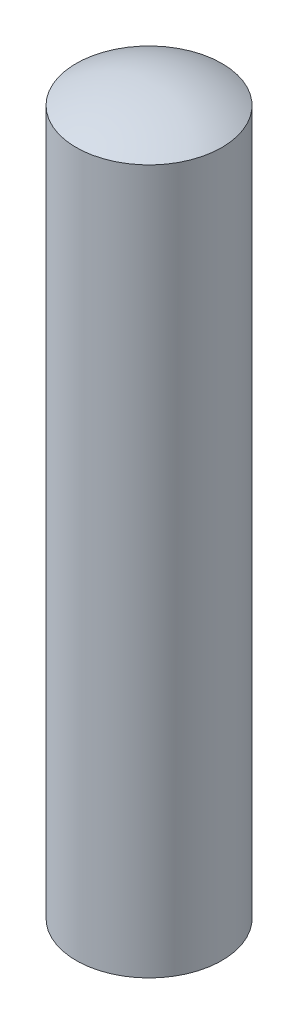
ISO-10303-21;
HEADER;
FILE_DESCRIPTION(('STEP AP214'),'2;1');
FILE_NAME('part.step','',(''),(''),'','','');
FILE_SCHEMA(('AUTOMOTIVE_DESIGN { 1 0 10303 214 1 1 1 1 }'));
ENDSEC;
DATA;
#1=APPLICATION_CONTEXT('core data for automotive mechanical design processes');
#2=APPLICATION_PROTOCOL_DEFINITION('international standard','automotive_design',2000,#1);
#3=PRODUCT_CONTEXT('',#1,'mechanical');
#4=PRODUCT('Part','Part','',(#3));
#5=PRODUCT_RELATED_PRODUCT_CATEGORY('part','',(#4));
#6=PRODUCT_DEFINITION_FORMATION('','',#4);
#7=PRODUCT_DEFINITION_CONTEXT('part definition',#1,'design');
#8=PRODUCT_DEFINITION('design','',#6,#7);
#9=PRODUCT_DEFINITION_SHAPE('','',#8);
#10=(LENGTH_UNIT() NAMED_UNIT(*) SI_UNIT(.MILLI.,.METRE.));
#11=(NAMED_UNIT(*) PLANE_ANGLE_UNIT() SI_UNIT($,.RADIAN.));
#12=(NAMED_UNIT(*) SI_UNIT($,.STERADIAN.) SOLID_ANGLE_UNIT());
#13=UNCERTAINTY_MEASURE_WITH_UNIT(LENGTH_MEASURE(1.E-05),#10,'distance_accuracy_value','');
#14=(GEOMETRIC_REPRESENTATION_CONTEXT(3) GLOBAL_UNCERTAINTY_ASSIGNED_CONTEXT((#13)) GLOBAL_UNIT_ASSIGNED_CONTEXT((#10,
#11,#12)) REPRESENTATION_CONTEXT('',''));
#15=CARTESIAN_POINT('',(0.,0.,0.));
#16=DIRECTION('',(0.,0.,1.));
#17=DIRECTION('',(1.,0.,0.));
#18=AXIS2_PLACEMENT_3D('',#15,#16,#17);
#19=CARTESIAN_POINT('',(0.,0.,0.));
#20=DIRECTION('',(0.,-1.,0.));
#21=DIRECTION('',(-1.,0.,0.));
#22=AXIS2_PLACEMENT_3D('',#19,#20,#21);
#23=SPHERICAL_SURFACE('',#22,10.);
#24=CARTESIAN_POINT('',(0.,-8.66025403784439,0.));
#25=DIRECTION('',(0.,-1.,0.));
#26=DIRECTION('',(0.,0.,-1.));
#27=AXIS2_PLACEMENT_3D('',#24,#25,#26);
#28=CIRCLE('',#27,5.);
#29=CARTESIAN_POINT('',(0.,-8.66025403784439,-5.));
#30=VERTEX_POINT('',#29);
#31=EDGE_CURVE('E10',#30,#30,#28,.T.);
#32=ORIENTED_EDGE('',*,*,#31,.T.);
#33=EDGE_LOOP('',(#32));
#34=FACE_BOUND('',#33,.T.);
#35=ADVANCED_FACE('F33',(#34),#23,.T.);
#36=CARTESIAN_POINT('',(0.,-10.,0.));
#37=DIRECTION('',(0.,-1.,0.));
#38=DIRECTION('',(0.,0.,-1.));
#39=AXIS2_PLACEMENT_3D('',#36,#37,#38);
#40=CYLINDRICAL_SURFACE('',#39,5.);
#41=CARTESIAN_POINT('',(0.,39.6602540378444,0.));
#42=DIRECTION('',(0.,-1.,0.));
#43=DIRECTION('',(0.,0.,-1.));
#44=AXIS2_PLACEMENT_3D('',#41,#42,#43);
#45=CIRCLE('',#44,5.);
#46=CARTESIAN_POINT('',(0.,39.6602540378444,-5.));
#47=VERTEX_POINT('',#46);
#48=EDGE_CURVE('E39',#47,#47,#45,.T.);
#49=ORIENTED_EDGE('',*,*,#48,.T.);
#50=EDGE_LOOP('',(#49));
#51=FACE_BOUND('',#50,.T.);
#52=ORIENTED_EDGE('',*,*,#31,.F.);
#53=EDGE_LOOP('',(#52));
#54=FACE_BOUND('',#53,.T.);
#55=ADVANCED_FACE('F49',(#51,#54),#40,.T.);
#56=CARTESIAN_POINT('',(0.,31.,0.));
#57=DIRECTION('',(0.,-1.,0.));
#58=DIRECTION('',(1.,0.,0.));
#59=AXIS2_PLACEMENT_3D('',#56,#57,#58);
#60=SPHERICAL_SURFACE('',#59,10.);
#61=ORIENTED_EDGE('',*,*,#48,.F.);
#62=EDGE_LOOP('',(#61));
#63=FACE_BOUND('',#62,.T.);
#64=ADVANCED_FACE('F52',(#63),#60,.T.);
#65=CLOSED_SHELL('',(#35,#55,#64));
#66=MANIFOLD_SOLID_BREP('B2',#65);
#67=ADVANCED_BREP_SHAPE_REPRESENTATION('',(#18,#66),#14);
#68=SHAPE_DEFINITION_REPRESENTATION(#9,#67);
ENDSEC;
END-ISO-10303-21;
